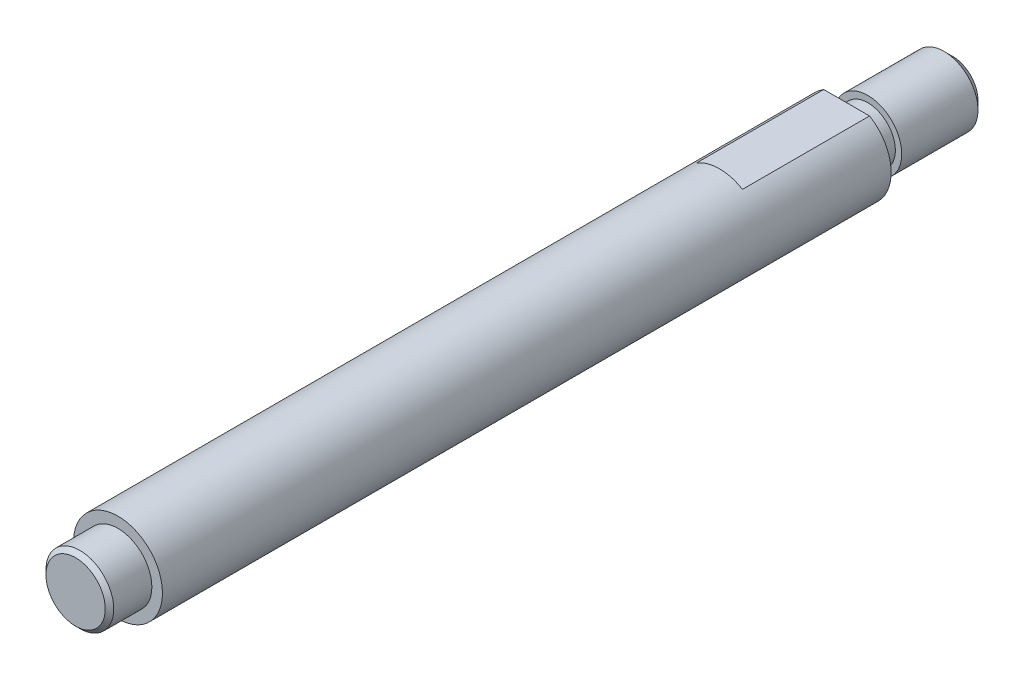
from build123d import *

# Parameters (mm, degrees)
ESQUISSE1_R             = 5.25
EXTRUSION1_DEPTH        = 86
ESQUISSE2_R             = 4
EXTRUSION2_DEPTH        = 5
ESQUISSE3_R             = 3.25
EXTRUSION3_DEPTH        = 2.5
EXTRUSION4_START        = 10
ESQUISSE4_R             = 4
EXTRUSION4_DEPTH        = 10
CHANFREIN1_SIZE         = 1
CHANFREIN2_SIZE         = 0.5
ESQUISSE5_W             = 57.328535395
ESQUISSE5_H             = 15
ENL_V_MAT_EXTRU_1_DEPTH = 92.671287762
ESQUISSE7_W             = 5.408326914
ESQUISSE7_H             = 15
ENL_V_MAT_EXTRU_2_DEPTH = 92.671287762


with BuildPart() as part:
    # Esquisse1 → Extrusion1 (new body)
    with BuildSketch(Plane.XY):
        Circle(ESQUISSE1_R)
    extrude(amount=EXTRUSION1_DEPTH)

    # Esquisse2 → Extrusion2 (add)
    with BuildSketch(Plane.XY.offset(86)):
        Circle(ESQUISSE2_R)
    extrude(amount=EXTRUSION2_DEPTH)

    # Esquisse3 → Extrusion3 (add)
    with BuildSketch(Plane(origin=(0, 0, 0), x_dir=(-1, 0, 0), z_dir=(0, 0, -1))):
        with Locations(Location((0, 0, 0), (0, 0, 180))):
            Circle(ESQUISSE3_R)
    extrude(amount=EXTRUSION3_DEPTH)

    # Esquisse4 → Extrusion4 (add)
    with BuildSketch(Plane(origin=(0, 0, -2.5), x_dir=(-1, 0, 0), z_dir=(0, 0, -1)).offset(EXTRUSION4_START)):
        with Locations(Location((0, 0, 0), (0, 0, 180))):
            Circle(ESQUISSE4_R)
    extrude(amount=-EXTRUSION4_DEPTH)

    # Chanfrein1
    chanfrein1_edges = [part.edges().sort_by_distance(p)[0] for p in [
        (-4, 0, -12.5),
    ]]
    chamfer(chanfrein1_edges, length=CHANFREIN1_SIZE)

    # Chanfrein2
    chanfrein2_edges = [part.edges().sort_by_distance(p)[0] for p in [
        (-4, 0, 91),
    ]]
    chamfer(chanfrein2_edges, length=CHANFREIN2_SIZE)

    # Esquisse5 → Enl_v. mat.-Extru.1 (cut, through all)
    with BuildSketch(Plane(origin=(0, 4.5, 0), x_dir=(-1, 0, 0), z_dir=(0, 1, 0))):
        with Locations((-4.845849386, 7.5)):
            Rectangle(ESQUISSE5_W, ESQUISSE5_H)
    extrude(amount=ENL_V_MAT_EXTRU_1_DEPTH, mode=Mode.SUBTRACT)

    # Esquisse7 → Enl_v. mat.-Extru.2 (cut, through all)
    with BuildSketch(Plane(origin=(0, -4.5, 0), x_dir=(-1, 0, 0), z_dir=(0, 1, 0))):
        with Locations((0, 7.5)):
            Rectangle(ESQUISSE7_W, ESQUISSE7_H)
    extrude(amount=-ENL_V_MAT_EXTRU_2_DEPTH, mode=Mode.SUBTRACT)


solid = part.part
